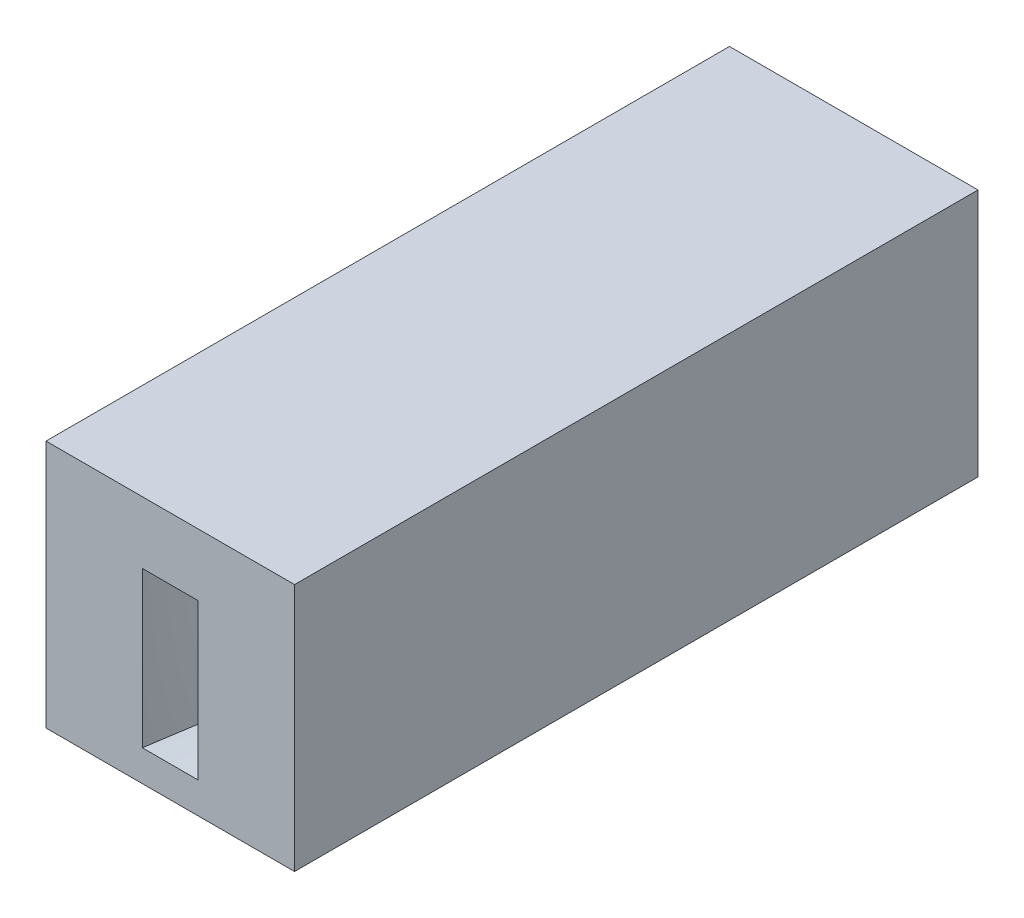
ISO-10303-21;
HEADER;
FILE_DESCRIPTION(('STEP AP214'),'2;1');
FILE_NAME('part.step','',(''),(''),'','','');
FILE_SCHEMA(('AUTOMOTIVE_DESIGN { 1 0 10303 214 1 1 1 1 }'));
ENDSEC;
DATA;
#1=APPLICATION_CONTEXT('core data for automotive mechanical design processes');
#2=APPLICATION_PROTOCOL_DEFINITION('international standard','automotive_design',2000,#1);
#3=PRODUCT_CONTEXT('',#1,'mechanical');
#4=PRODUCT('Part','Part','',(#3));
#5=PRODUCT_RELATED_PRODUCT_CATEGORY('part','',(#4));
#6=PRODUCT_DEFINITION_FORMATION('','',#4);
#7=PRODUCT_DEFINITION_CONTEXT('part definition',#1,'design');
#8=PRODUCT_DEFINITION('design','',#6,#7);
#9=PRODUCT_DEFINITION_SHAPE('','',#8);
#10=(LENGTH_UNIT() NAMED_UNIT(*) SI_UNIT(.MILLI.,.METRE.));
#11=(NAMED_UNIT(*) PLANE_ANGLE_UNIT() SI_UNIT($,.RADIAN.));
#12=(NAMED_UNIT(*) SI_UNIT($,.STERADIAN.) SOLID_ANGLE_UNIT());
#13=UNCERTAINTY_MEASURE_WITH_UNIT(LENGTH_MEASURE(1.E-05),#10,'distance_accuracy_value','');
#14=(GEOMETRIC_REPRESENTATION_CONTEXT(3) GLOBAL_UNCERTAINTY_ASSIGNED_CONTEXT((#13)) GLOBAL_UNIT_ASSIGNED_CONTEXT((#10,
#11,#12)) REPRESENTATION_CONTEXT('',''));
#15=CARTESIAN_POINT('',(0.,0.,0.));
#16=DIRECTION('',(0.,0.,1.));
#17=DIRECTION('',(1.,0.,0.));
#18=AXIS2_PLACEMENT_3D('',#15,#16,#17);
#19=CARTESIAN_POINT('',(24.,-198.,200.));
#20=DIRECTION('',(0.,0.,-1.));
#21=DIRECTION('',(-1.,0.,0.));
#22=AXIS2_PLACEMENT_3D('',#19,#20,#21);
#23=PLANE('',#22);
#24=DIRECTION('',(0.,-1.,0.));
#25=VECTOR('',#24,1.);
#26=CARTESIAN_POINT('',(24.,-278.,200.));
#27=LINE('',#26,#25);
#28=CARTESIAN_POINT('',(24.,-198.,200.));
#29=VERTEX_POINT('',#28);
#30=CARTESIAN_POINT('',(24.,-278.,200.));
#31=VERTEX_POINT('',#30);
#32=EDGE_CURVE('E132',#29,#31,#27,.T.);
#33=ORIENTED_EDGE('',*,*,#32,.T.);
#34=DIRECTION('',(1.,0.,0.));
#35=VECTOR('',#34,1.);
#36=CARTESIAN_POINT('',(24.,-278.,200.));
#37=LINE('',#36,#35);
#38=CARTESIAN_POINT('',(104.,-278.,200.));
#39=VERTEX_POINT('',#38);
#40=EDGE_CURVE('E135',#31,#39,#37,.T.);
#41=ORIENTED_EDGE('',*,*,#40,.T.);
#42=DIRECTION('',(0.,1.,0.));
#43=VECTOR('',#42,1.);
#44=CARTESIAN_POINT('',(104.,-278.,200.));
#45=LINE('',#44,#43);
#46=CARTESIAN_POINT('',(104.,-198.,200.));
#47=VERTEX_POINT('',#46);
#48=EDGE_CURVE('E210',#39,#47,#45,.T.);
#49=ORIENTED_EDGE('',*,*,#48,.T.);
#50=DIRECTION('',(-1.,0.,0.));
#51=VECTOR('',#50,1.);
#52=CARTESIAN_POINT('',(24.,-198.,200.));
#53=LINE('',#52,#51);
#54=EDGE_CURVE('E213',#47,#29,#53,.T.);
#55=ORIENTED_EDGE('',*,*,#54,.T.);
#56=EDGE_LOOP('',(#33,#41,#49,#55));
#57=FACE_BOUND('',#56,.T.);
#58=DIRECTION('',(0.,-1.,0.));
#59=VECTOR('',#58,1.);
#60=CARTESIAN_POINT('',(55.,-268.,200.));
#61=LINE('',#60,#59);
#62=CARTESIAN_POINT('',(55.,-218.,200.));
#63=VERTEX_POINT('',#62);
#64=CARTESIAN_POINT('',(55.,-268.,200.));
#65=VERTEX_POINT('',#64);
#66=EDGE_CURVE('E113',#63,#65,#61,.T.);
#67=ORIENTED_EDGE('',*,*,#66,.F.);
#68=DIRECTION('',(-1.,0.,0.));
#69=VECTOR('',#68,1.);
#70=CARTESIAN_POINT('',(55.,-218.,200.));
#71=LINE('',#70,#69);
#72=CARTESIAN_POINT('',(73.,-218.,200.));
#73=VERTEX_POINT('',#72);
#74=EDGE_CURVE('E154',#73,#63,#71,.T.);
#75=ORIENTED_EDGE('',*,*,#74,.F.);
#76=DIRECTION('',(0.,1.,0.));
#77=VECTOR('',#76,1.);
#78=CARTESIAN_POINT('',(73.,-268.,200.));
#79=LINE('',#78,#77);
#80=CARTESIAN_POINT('',(73.,-268.,200.));
#81=VERTEX_POINT('',#80);
#82=EDGE_CURVE('E146',#81,#73,#79,.T.);
#83=ORIENTED_EDGE('',*,*,#82,.F.);
#84=DIRECTION('',(1.,0.,0.));
#85=VECTOR('',#84,1.);
#86=CARTESIAN_POINT('',(55.,-268.,200.));
#87=LINE('',#86,#85);
#88=EDGE_CURVE('E152',#65,#81,#87,.T.);
#89=ORIENTED_EDGE('',*,*,#88,.F.);
#90=EDGE_LOOP('',(#67,#75,#83,#89));
#91=FACE_BOUND('',#90,.T.);
#92=ADVANCED_FACE('F43',(#57,#91),#23,.F.);
#93=CARTESIAN_POINT('',(24.,-278.,-20.));
#94=DIRECTION('',(-1.,0.,0.));
#95=DIRECTION('',(0.,0.,1.));
#96=AXIS2_PLACEMENT_3D('',#93,#94,#95);
#97=PLANE('',#96);
#98=DIRECTION('',(0.,0.,1.));
#99=VECTOR('',#98,1.);
#100=CARTESIAN_POINT('',(24.,-278.,-20.));
#101=LINE('',#100,#99);
#102=CARTESIAN_POINT('',(24.,-278.,-20.));
#103=VERTEX_POINT('',#102);
#104=EDGE_CURVE('E227',#103,#31,#101,.T.);
#105=ORIENTED_EDGE('',*,*,#104,.T.);
#106=ORIENTED_EDGE('',*,*,#32,.F.);
#107=DIRECTION('',(0.,0.,1.));
#108=VECTOR('',#107,1.);
#109=CARTESIAN_POINT('',(24.,-198.,-20.));
#110=LINE('',#109,#108);
#111=CARTESIAN_POINT('',(24.,-198.,-20.));
#112=VERTEX_POINT('',#111);
#113=EDGE_CURVE('E12',#112,#29,#110,.T.);
#114=ORIENTED_EDGE('',*,*,#113,.F.);
#115=DIRECTION('',(0.,-1.,0.));
#116=VECTOR('',#115,1.);
#117=CARTESIAN_POINT('',(24.,-278.,-20.));
#118=LINE('',#117,#116);
#119=EDGE_CURVE('E216',#112,#103,#118,.T.);
#120=ORIENTED_EDGE('',*,*,#119,.T.);
#121=EDGE_LOOP('',(#105,#106,#114,#120));
#122=FACE_BOUND('',#121,.T.);
#123=ADVANCED_FACE('F45',(#122),#97,.T.);
#124=CARTESIAN_POINT('',(24.,-198.,-20.));
#125=DIRECTION('',(0.,1.,0.));
#126=DIRECTION('',(0.,0.,1.));
#127=AXIS2_PLACEMENT_3D('',#124,#125,#126);
#128=PLANE('',#127);
#129=ORIENTED_EDGE('',*,*,#113,.T.);
#130=ORIENTED_EDGE('',*,*,#54,.F.);
#131=DIRECTION('',(0.,0.,1.));
#132=VECTOR('',#131,1.);
#133=CARTESIAN_POINT('',(104.,-198.,-20.));
#134=LINE('',#133,#132);
#135=CARTESIAN_POINT('',(104.,-198.,-20.));
#136=VERTEX_POINT('',#135);
#137=EDGE_CURVE('E52',#136,#47,#134,.T.);
#138=ORIENTED_EDGE('',*,*,#137,.F.);
#139=DIRECTION('',(-1.,0.,0.));
#140=VECTOR('',#139,1.);
#141=CARTESIAN_POINT('',(24.,-198.,-20.));
#142=LINE('',#141,#140);
#143=EDGE_CURVE('E225',#136,#112,#142,.T.);
#144=ORIENTED_EDGE('',*,*,#143,.T.);
#145=EDGE_LOOP('',(#129,#130,#138,#144));
#146=FACE_BOUND('',#145,.T.);
#147=ADVANCED_FACE('F242',(#146),#128,.T.);
#148=CARTESIAN_POINT('',(104.,-278.,-20.));
#149=DIRECTION('',(1.,0.,0.));
#150=DIRECTION('',(0.,0.,-1.));
#151=AXIS2_PLACEMENT_3D('',#148,#149,#150);
#152=PLANE('',#151);
#153=ORIENTED_EDGE('',*,*,#137,.T.);
#154=ORIENTED_EDGE('',*,*,#48,.F.);
#155=DIRECTION('',(0.,0.,1.));
#156=VECTOR('',#155,1.);
#157=CARTESIAN_POINT('',(104.,-278.,-20.));
#158=LINE('',#157,#156);
#159=CARTESIAN_POINT('',(104.,-278.,-20.));
#160=VERTEX_POINT('',#159);
#161=EDGE_CURVE('E230',#160,#39,#158,.T.);
#162=ORIENTED_EDGE('',*,*,#161,.F.);
#163=DIRECTION('',(0.,1.,0.));
#164=VECTOR('',#163,1.);
#165=CARTESIAN_POINT('',(104.,-278.,-20.));
#166=LINE('',#165,#164);
#167=EDGE_CURVE('E222',#160,#136,#166,.T.);
#168=ORIENTED_EDGE('',*,*,#167,.T.);
#169=EDGE_LOOP('',(#153,#154,#162,#168));
#170=FACE_BOUND('',#169,.T.);
#171=ADVANCED_FACE('F246',(#170),#152,.T.);
#172=CARTESIAN_POINT('',(24.,-278.,-20.));
#173=DIRECTION('',(0.,-1.,0.));
#174=DIRECTION('',(0.,0.,-1.));
#175=AXIS2_PLACEMENT_3D('',#172,#173,#174);
#176=PLANE('',#175);
#177=ORIENTED_EDGE('',*,*,#161,.T.);
#178=ORIENTED_EDGE('',*,*,#40,.F.);
#179=ORIENTED_EDGE('',*,*,#104,.F.);
#180=DIRECTION('',(1.,0.,0.));
#181=VECTOR('',#180,1.);
#182=CARTESIAN_POINT('',(24.,-278.,-20.));
#183=LINE('',#182,#181);
#184=EDGE_CURVE('E219',#103,#160,#183,.T.);
#185=ORIENTED_EDGE('',*,*,#184,.T.);
#186=EDGE_LOOP('',(#177,#178,#179,#185));
#187=FACE_BOUND('',#186,.T.);
#188=ADVANCED_FACE('F238',(#187),#176,.T.);
#189=CARTESIAN_POINT('',(24.,-198.,-20.));
#190=DIRECTION('',(0.,0.,-1.));
#191=DIRECTION('',(-1.,0.,0.));
#192=AXIS2_PLACEMENT_3D('',#189,#190,#191);
#193=PLANE('',#192);
#194=DIRECTION('',(0.,-1.,0.));
#195=VECTOR('',#194,1.);
#196=CARTESIAN_POINT('',(89.,-268.,-20.));
#197=LINE('',#196,#195);
#198=CARTESIAN_POINT('',(89.,-250.,-20.));
#199=VERTEX_POINT('',#198);
#200=CARTESIAN_POINT('',(89.,-268.,-20.));
#201=VERTEX_POINT('',#200);
#202=EDGE_CURVE('E121',#199,#201,#197,.T.);
#203=ORIENTED_EDGE('',*,*,#202,.F.);
#204=DIRECTION('',(1.,0.,0.));
#205=VECTOR('',#204,1.);
#206=CARTESIAN_POINT('',(89.,-250.,-20.));
#207=LINE('',#206,#205);
#208=CARTESIAN_POINT('',(39.,-250.,-20.));
#209=VERTEX_POINT('',#208);
#210=EDGE_CURVE('E126',#209,#199,#207,.T.);
#211=ORIENTED_EDGE('',*,*,#210,.F.);
#212=DIRECTION('',(0.,1.,0.));
#213=VECTOR('',#212,1.);
#214=CARTESIAN_POINT('',(39.,-268.,-20.));
#215=LINE('',#214,#213);
#216=CARTESIAN_POINT('',(39.,-268.,-20.));
#217=VERTEX_POINT('',#216);
#218=EDGE_CURVE('E131',#217,#209,#215,.T.);
#219=ORIENTED_EDGE('',*,*,#218,.F.);
#220=DIRECTION('',(-1.,0.,0.));
#221=VECTOR('',#220,1.);
#222=CARTESIAN_POINT('',(89.,-268.,-20.));
#223=LINE('',#222,#221);
#224=EDGE_CURVE('E110',#201,#217,#223,.T.);
#225=ORIENTED_EDGE('',*,*,#224,.F.);
#226=EDGE_LOOP('',(#203,#211,#219,#225));
#227=FACE_BOUND('',#226,.T.);
#228=ORIENTED_EDGE('',*,*,#119,.F.);
#229=ORIENTED_EDGE('',*,*,#143,.F.);
#230=ORIENTED_EDGE('',*,*,#167,.F.);
#231=ORIENTED_EDGE('',*,*,#184,.F.);
#232=EDGE_LOOP('',(#228,#229,#230,#231));
#233=FACE_BOUND('',#232,.T.);
#234=ADVANCED_FACE('F129',(#227,#233),#193,.T.);
#235=CARTESIAN_POINT('',(89.,-268.,-20.));
#236=CARTESIAN_POINT('',(55.,-268.,200.));
#237=CARTESIAN_POINT('',(89.,-265.,-20.));
#238=CARTESIAN_POINT('',(58.0000000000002,-268.,200.));
#239=CARTESIAN_POINT('',(89.,-262.,-20.));
#240=CARTESIAN_POINT('',(61.0000000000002,-268.,200.));
#241=CARTESIAN_POINT('',(89.,-256.,-20.));
#242=CARTESIAN_POINT('',(67.0000000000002,-268.,200.));
#243=CARTESIAN_POINT('',(89.,-253.,-20.));
#244=CARTESIAN_POINT('',(70.0000000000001,-268.,200.));
#245=CARTESIAN_POINT('',(89.,-250.,-20.));
#246=CARTESIAN_POINT('',(73.,-268.,200.));
#247=B_SPLINE_SURFACE_WITH_KNOTS('',3,1,((#235,#236),(#237,#238),(#239,#240),(#241,#242),(#243,
#244),(#245,#246)),.UNSPECIFIED.,.F.,.F.,.F.,(4,2,4),(2,2),(0.,0.5,1.),(0.,1.),.UNSPECIFIED.);
#248=DIRECTION('',(0.15273226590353,0.,-0.988267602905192));
#249=VECTOR('',#248,1.);
#250=CARTESIAN_POINT('',(72.,-268.,90.));
#251=LINE('',#250,#249);
#252=EDGE_CURVE('E105',#65,#201,#251,.T.);
#253=DIRECTION('',(-0.0722953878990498,-0.081332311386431,0.994061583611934));
#254=VECTOR('',#253,1.);
#255=CARTESIAN_POINT('',(81.,-259.,90.));
#256=LINE('',#255,#254);
#257=EDGE_CURVE('E117',#199,#81,#256,.T.);
#258=ORIENTED_EDGE('',*,*,#202,.T.);
#259=ORIENTED_EDGE('',*,*,#252,.F.);
#260=ORIENTED_EDGE('',*,*,#88,.T.);
#261=ORIENTED_EDGE('',*,*,#257,.F.);
#262=EDGE_LOOP('',(#258,#259,#260,#261));
#263=FACE_BOUND('',#262,.T.);
#264=ADVANCED_FACE('F122',(#263),#247,.F.);
#265=CARTESIAN_POINT('',(89.,-250.,-20.));
#266=CARTESIAN_POINT('',(73.,-268.,200.));
#267=CARTESIAN_POINT('',(80.6666666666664,-250.,-20.));
#268=CARTESIAN_POINT('',(73.,-259.666666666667,200.));
#269=CARTESIAN_POINT('',(72.333333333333,-250.,-20.));
#270=CARTESIAN_POINT('',(73.,-251.333333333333,200.));
#271=CARTESIAN_POINT('',(55.6666666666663,-250.,-20.));
#272=CARTESIAN_POINT('',(73.,-234.666666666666,200.));
#273=CARTESIAN_POINT('',(47.3333333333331,-250.,-20.));
#274=CARTESIAN_POINT('',(73.,-226.333333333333,200.));
#275=CARTESIAN_POINT('',(39.,-250.,-20.));
#276=CARTESIAN_POINT('',(73.,-218.,200.));
#277=B_SPLINE_SURFACE_WITH_KNOTS('',3,1,((#265,#266),(#267,#268),(#269,#270),(#271,#272),(#273,
#274),(#275,#276)),.UNSPECIFIED.,.F.,.F.,.F.,(4,2,4),(2,2),(0.,0.5,1.),(0.,1.),.UNSPECIFIED.);
#278=DIRECTION('',(0.151178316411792,0.142285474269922,0.978212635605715));
#279=VECTOR('',#278,1.);
#280=CARTESIAN_POINT('',(56.,-234.,90.));
#281=LINE('',#280,#279);
#282=EDGE_CURVE('E60',#209,#73,#281,.T.);
#283=ORIENTED_EDGE('',*,*,#210,.T.);
#284=ORIENTED_EDGE('',*,*,#257,.T.);
#285=ORIENTED_EDGE('',*,*,#82,.T.);
#286=ORIENTED_EDGE('',*,*,#282,.F.);
#287=EDGE_LOOP('',(#283,#284,#285,#286));
#288=FACE_BOUND('',#287,.T.);
#289=ADVANCED_FACE('F144',(#288),#277,.F.);
#290=CARTESIAN_POINT('',(39.,-268.,-20.));
#291=CARTESIAN_POINT('',(55.,-218.,200.));
#292=CARTESIAN_POINT('',(47.3333333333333,-268.,-20.));
#293=CARTESIAN_POINT('',(55.,-226.333333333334,200.));
#294=CARTESIAN_POINT('',(55.6666666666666,-268.,-20.));
#295=CARTESIAN_POINT('',(55.,-234.666666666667,200.));
#296=CARTESIAN_POINT('',(72.3333333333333,-268.,-20.));
#297=CARTESIAN_POINT('',(55.,-251.333333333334,200.));
#298=CARTESIAN_POINT('',(80.6666666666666,-268.,-20.));
#299=CARTESIAN_POINT('',(55.,-259.666666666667,200.));
#300=CARTESIAN_POINT('',(89.,-268.,-20.));
#301=CARTESIAN_POINT('',(55.,-268.,200.));
#302=B_SPLINE_SURFACE_WITH_KNOTS('',3,1,((#290,#291),(#292,#293),(#294,#295),(#296,#297),(#298,
#299),(#300,#301)),.UNSPECIFIED.,.F.,.F.,.F.,(4,2,4),(2,2),(0.,0.5,1.),(0.,1.),.UNSPECIFIED.);
#303=DIRECTION('',(0.0707410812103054,0.221065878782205,0.9726898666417));
#304=VECTOR('',#303,1.);
#305=CARTESIAN_POINT('',(47.,-243.,90.));
#306=LINE('',#305,#304);
#307=EDGE_CURVE('E316',#217,#63,#306,.T.);
#308=ORIENTED_EDGE('',*,*,#224,.T.);
#309=ORIENTED_EDGE('',*,*,#307,.T.);
#310=ORIENTED_EDGE('',*,*,#66,.T.);
#311=ORIENTED_EDGE('',*,*,#252,.T.);
#312=EDGE_LOOP('',(#308,#309,#310,#311));
#313=FACE_BOUND('',#312,.T.);
#314=ADVANCED_FACE('F107',(#313),#302,.F.);
#315=CARTESIAN_POINT('',(39.,-250.,-20.));
#316=CARTESIAN_POINT('',(73.,-218.,200.));
#317=CARTESIAN_POINT('',(39.,-253.,-20.));
#318=CARTESIAN_POINT('',(70.,-218.,200.));
#319=CARTESIAN_POINT('',(39.,-256.,-20.));
#320=CARTESIAN_POINT('',(67.,-218.,200.));
#321=CARTESIAN_POINT('',(39.,-262.,-20.));
#322=CARTESIAN_POINT('',(61.,-218.,200.));
#323=CARTESIAN_POINT('',(39.,-265.,-20.));
#324=CARTESIAN_POINT('',(58.,-218.,200.));
#325=CARTESIAN_POINT('',(39.,-268.,-20.));
#326=CARTESIAN_POINT('',(55.,-218.,200.));
#327=B_SPLINE_SURFACE_WITH_KNOTS('',3,1,((#315,#316),(#317,#318),(#319,#320),(#321,#322),(#323,
#324),(#325,#326)),.UNSPECIFIED.,.F.,.F.,.F.,(4,2,4),(2,2),(0.,0.5,1.),(0.,1.),.UNSPECIFIED.);
#328=ORIENTED_EDGE('',*,*,#218,.T.);
#329=ORIENTED_EDGE('',*,*,#282,.T.);
#330=ORIENTED_EDGE('',*,*,#74,.T.);
#331=ORIENTED_EDGE('',*,*,#307,.F.);
#332=EDGE_LOOP('',(#328,#329,#330,#331));
#333=FACE_BOUND('',#332,.T.);
#334=ADVANCED_FACE('F175',(#333),#327,.F.);
#335=CLOSED_SHELL('',(#92,#123,#147,#171,#188,#234,#264,#289,#314,#334));
#336=MANIFOLD_SOLID_BREP('B2',#335);
#337=ADVANCED_BREP_SHAPE_REPRESENTATION('',(#18,#336),#14);
#338=SHAPE_DEFINITION_REPRESENTATION(#9,#337);
ENDSEC;
END-ISO-10303-21;
